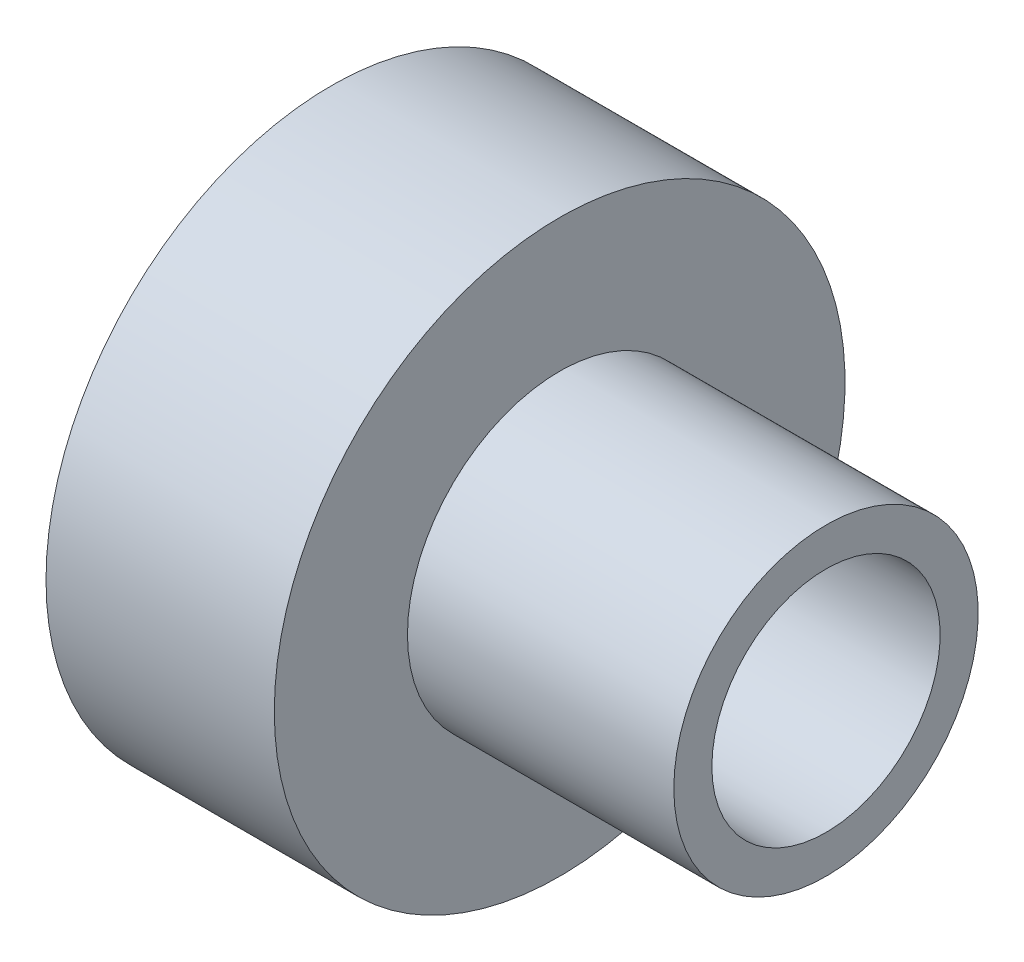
ISO-10303-21;
HEADER;
FILE_DESCRIPTION(('STEP AP214'),'2;1');
FILE_NAME('part.step','',(''),(''),'','','');
FILE_SCHEMA(('AUTOMOTIVE_DESIGN { 1 0 10303 214 1 1 1 1 }'));
ENDSEC;
DATA;
#1=APPLICATION_CONTEXT('core data for automotive mechanical design processes');
#2=APPLICATION_PROTOCOL_DEFINITION('international standard','automotive_design',2000,#1);
#3=PRODUCT_CONTEXT('',#1,'mechanical');
#4=PRODUCT('Part','Part','',(#3));
#5=PRODUCT_RELATED_PRODUCT_CATEGORY('part','',(#4));
#6=PRODUCT_DEFINITION_FORMATION('','',#4);
#7=PRODUCT_DEFINITION_CONTEXT('part definition',#1,'design');
#8=PRODUCT_DEFINITION('design','',#6,#7);
#9=PRODUCT_DEFINITION_SHAPE('','',#8);
#10=(LENGTH_UNIT() NAMED_UNIT(*) SI_UNIT(.MILLI.,.METRE.));
#11=(NAMED_UNIT(*) PLANE_ANGLE_UNIT() SI_UNIT($,.RADIAN.));
#12=(NAMED_UNIT(*) SI_UNIT($,.STERADIAN.) SOLID_ANGLE_UNIT());
#13=UNCERTAINTY_MEASURE_WITH_UNIT(LENGTH_MEASURE(1.E-05),#10,'distance_accuracy_value','');
#14=(GEOMETRIC_REPRESENTATION_CONTEXT(3) GLOBAL_UNCERTAINTY_ASSIGNED_CONTEXT((#13)) GLOBAL_UNIT_ASSIGNED_CONTEXT((#10,
#11,#12)) REPRESENTATION_CONTEXT('',''));
#15=CARTESIAN_POINT('',(0.,0.,0.));
#16=DIRECTION('',(0.,0.,1.));
#17=DIRECTION('',(1.,0.,0.));
#18=AXIS2_PLACEMENT_3D('',#15,#16,#17);
#19=CARTESIAN_POINT('',(8.71069888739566,7.5,0.));
#20=DIRECTION('',(1.,0.,0.));
#21=DIRECTION('',(0.,0.,-1.));
#22=AXIS2_PLACEMENT_3D('',#19,#20,#21);
#23=PLANE('',#22);
#24=CARTESIAN_POINT('',(8.71069888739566,0.,0.));
#25=DIRECTION('',(-1.,0.,0.));
#26=DIRECTION('',(0.,0.,1.));
#27=AXIS2_PLACEMENT_3D('',#24,#25,#26);
#28=CIRCLE('',#27,3.);
#29=CARTESIAN_POINT('',(8.71069888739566,0.,3.));
#30=VERTEX_POINT('',#29);
#31=EDGE_CURVE('E10',#30,#30,#28,.T.);
#32=ORIENTED_EDGE('',*,*,#31,.F.);
#33=EDGE_LOOP('',(#32));
#34=FACE_BOUND('',#33,.T.);
#35=CARTESIAN_POINT('',(8.71069888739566,0.,0.));
#36=DIRECTION('',(-1.,0.,0.));
#37=DIRECTION('',(0.,0.,1.));
#38=AXIS2_PLACEMENT_3D('',#35,#36,#37);
#39=CIRCLE('',#38,7.5);
#40=CARTESIAN_POINT('',(8.71069888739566,0.,7.5));
#41=VERTEX_POINT('',#40);
#42=EDGE_CURVE('E51',#41,#41,#39,.T.);
#43=ORIENTED_EDGE('',*,*,#42,.T.);
#44=EDGE_LOOP('',(#43));
#45=FACE_BOUND('',#44,.T.);
#46=ADVANCED_FACE('F29',(#34,#45),#23,.F.);
#47=CARTESIAN_POINT('',(0.,0.,0.));
#48=DIRECTION('',(-1.,0.,0.));
#49=DIRECTION('',(0.,0.,1.));
#50=AXIS2_PLACEMENT_3D('',#47,#48,#49);
#51=CYLINDRICAL_SURFACE('',#50,3.);
#52=CARTESIAN_POINT('',(21.7106988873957,0.,0.));
#53=DIRECTION('',(-1.,0.,0.));
#54=DIRECTION('',(0.,0.,1.));
#55=AXIS2_PLACEMENT_3D('',#52,#53,#54);
#56=CIRCLE('',#55,3.);
#57=CARTESIAN_POINT('',(21.7106988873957,0.,3.));
#58=VERTEX_POINT('',#57);
#59=EDGE_CURVE('E35',#58,#58,#56,.T.);
#60=ORIENTED_EDGE('',*,*,#59,.F.);
#61=EDGE_LOOP('',(#60));
#62=FACE_BOUND('',#61,.T.);
#63=ORIENTED_EDGE('',*,*,#31,.T.);
#64=EDGE_LOOP('',(#63));
#65=FACE_BOUND('',#64,.T.);
#66=ADVANCED_FACE('F76',(#62,#65),#51,.F.);
#67=CARTESIAN_POINT('',(21.7106988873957,3.,0.));
#68=DIRECTION('',(-1.,0.,0.));
#69=DIRECTION('',(0.,0.,1.));
#70=AXIS2_PLACEMENT_3D('',#67,#68,#69);
#71=PLANE('',#70);
#72=CARTESIAN_POINT('',(21.7106988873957,0.,0.));
#73=DIRECTION('',(-1.,0.,0.));
#74=DIRECTION('',(0.,0.,1.));
#75=AXIS2_PLACEMENT_3D('',#72,#73,#74);
#76=CIRCLE('',#75,4.);
#77=CARTESIAN_POINT('',(21.7106988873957,0.,4.));
#78=VERTEX_POINT('',#77);
#79=EDGE_CURVE('E39',#78,#78,#76,.T.);
#80=ORIENTED_EDGE('',*,*,#79,.F.);
#81=EDGE_LOOP('',(#80));
#82=FACE_BOUND('',#81,.T.);
#83=ORIENTED_EDGE('',*,*,#59,.T.);
#84=EDGE_LOOP('',(#83));
#85=FACE_BOUND('',#84,.T.);
#86=ADVANCED_FACE('F71',(#82,#85),#71,.F.);
#87=CARTESIAN_POINT('',(0.,0.,0.));
#88=DIRECTION('',(-1.,0.,0.));
#89=DIRECTION('',(0.,0.,1.));
#90=AXIS2_PLACEMENT_3D('',#87,#88,#89);
#91=CYLINDRICAL_SURFACE('',#90,4.);
#92=CARTESIAN_POINT('',(14.7106988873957,0.,0.));
#93=DIRECTION('',(-1.,0.,0.));
#94=DIRECTION('',(0.,0.,1.));
#95=AXIS2_PLACEMENT_3D('',#92,#93,#94);
#96=CIRCLE('',#95,4.);
#97=CARTESIAN_POINT('',(14.7106988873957,0.,4.));
#98=VERTEX_POINT('',#97);
#99=EDGE_CURVE('E43',#98,#98,#96,.T.);
#100=ORIENTED_EDGE('',*,*,#99,.F.);
#101=EDGE_LOOP('',(#100));
#102=FACE_BOUND('',#101,.T.);
#103=ORIENTED_EDGE('',*,*,#79,.T.);
#104=EDGE_LOOP('',(#103));
#105=FACE_BOUND('',#104,.T.);
#106=ADVANCED_FACE('F65',(#102,#105),#91,.T.);
#107=CARTESIAN_POINT('',(14.7106988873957,4.,0.));
#108=DIRECTION('',(-1.,0.,0.));
#109=DIRECTION('',(0.,0.,1.));
#110=AXIS2_PLACEMENT_3D('',#107,#108,#109);
#111=PLANE('',#110);
#112=CARTESIAN_POINT('',(14.7106988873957,0.,0.));
#113=DIRECTION('',(-1.,0.,0.));
#114=DIRECTION('',(0.,0.,1.));
#115=AXIS2_PLACEMENT_3D('',#112,#113,#114);
#116=CIRCLE('',#115,7.5);
#117=CARTESIAN_POINT('',(14.7106988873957,0.,7.5));
#118=VERTEX_POINT('',#117);
#119=EDGE_CURVE('E48',#118,#118,#116,.T.);
#120=ORIENTED_EDGE('',*,*,#119,.F.);
#121=EDGE_LOOP('',(#120));
#122=FACE_BOUND('',#121,.T.);
#123=ORIENTED_EDGE('',*,*,#99,.T.);
#124=EDGE_LOOP('',(#123));
#125=FACE_BOUND('',#124,.T.);
#126=ADVANCED_FACE('F59',(#122,#125),#111,.F.);
#127=CARTESIAN_POINT('',(0.,0.,0.));
#128=DIRECTION('',(-1.,0.,0.));
#129=DIRECTION('',(0.,0.,1.));
#130=AXIS2_PLACEMENT_3D('',#127,#128,#129);
#131=CYLINDRICAL_SURFACE('',#130,7.5);
#132=ORIENTED_EDGE('',*,*,#42,.F.);
#133=EDGE_LOOP('',(#132));
#134=FACE_BOUND('',#133,.T.);
#135=ORIENTED_EDGE('',*,*,#119,.T.);
#136=EDGE_LOOP('',(#135));
#137=FACE_BOUND('',#136,.T.);
#138=ADVANCED_FACE('F56',(#134,#137),#131,.T.);
#139=CLOSED_SHELL('',(#46,#66,#86,#106,#126,#138));
#140=MANIFOLD_SOLID_BREP('B2',#139);
#141=ADVANCED_BREP_SHAPE_REPRESENTATION('',(#18,#140),#14);
#142=SHAPE_DEFINITION_REPRESENTATION(#9,#141);
ENDSEC;
END-ISO-10303-21;
